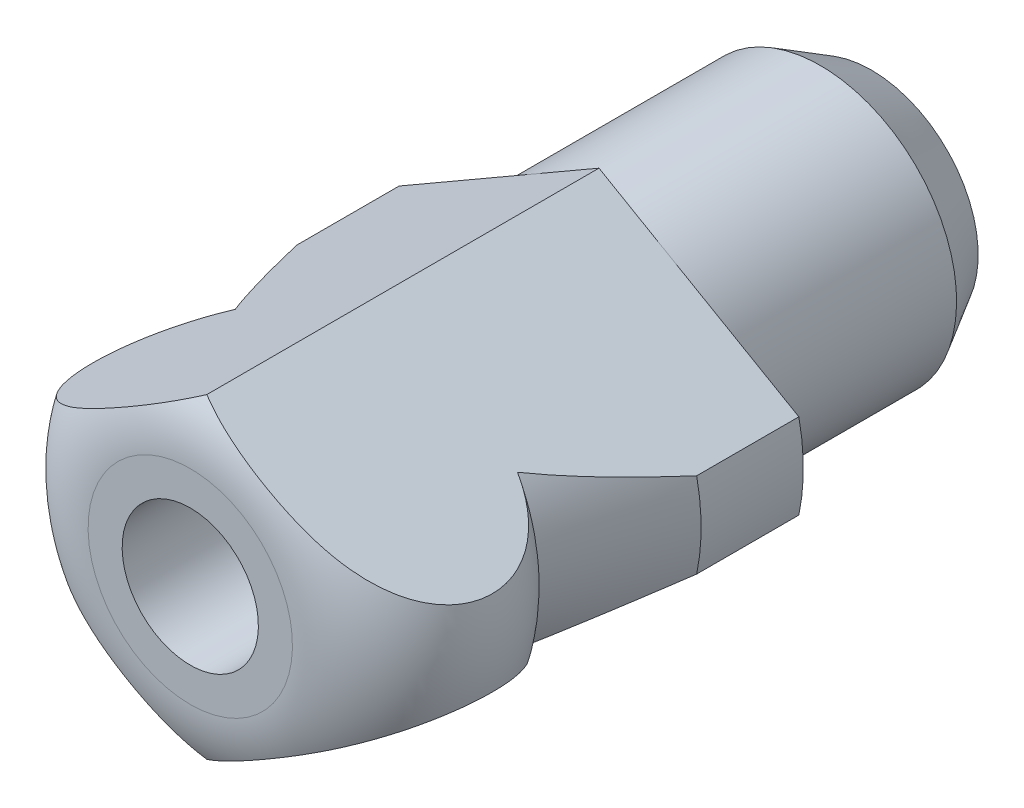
ISO-10303-21;
HEADER;
FILE_DESCRIPTION(('STEP AP214'),'2;1');
FILE_NAME('part.step','',(''),(''),'','','');
FILE_SCHEMA(('AUTOMOTIVE_DESIGN { 1 0 10303 214 1 1 1 1 }'));
ENDSEC;
DATA;
#1=APPLICATION_CONTEXT('core data for automotive mechanical design processes');
#2=APPLICATION_PROTOCOL_DEFINITION('international standard','automotive_design',2000,#1);
#3=PRODUCT_CONTEXT('',#1,'mechanical');
#4=PRODUCT('Part','Part','',(#3));
#5=PRODUCT_RELATED_PRODUCT_CATEGORY('part','',(#4));
#6=PRODUCT_DEFINITION_FORMATION('','',#4);
#7=PRODUCT_DEFINITION_CONTEXT('part definition',#1,'design');
#8=PRODUCT_DEFINITION('design','',#6,#7);
#9=PRODUCT_DEFINITION_SHAPE('','',#8);
#10=(LENGTH_UNIT() NAMED_UNIT(*) SI_UNIT(.MILLI.,.METRE.));
#11=(NAMED_UNIT(*) PLANE_ANGLE_UNIT() SI_UNIT($,.RADIAN.));
#12=(NAMED_UNIT(*) SI_UNIT($,.STERADIAN.) SOLID_ANGLE_UNIT());
#13=UNCERTAINTY_MEASURE_WITH_UNIT(LENGTH_MEASURE(1.E-05),#10,'distance_accuracy_value','');
#14=(GEOMETRIC_REPRESENTATION_CONTEXT(3) GLOBAL_UNCERTAINTY_ASSIGNED_CONTEXT((#13)) GLOBAL_UNIT_ASSIGNED_CONTEXT((#10,
#11,#12)) REPRESENTATION_CONTEXT('',''));
#15=CARTESIAN_POINT('',(0.,0.,0.));
#16=DIRECTION('',(0.,0.,1.));
#17=DIRECTION('',(1.,0.,0.));
#18=AXIS2_PLACEMENT_3D('',#15,#16,#17);
#19=CARTESIAN_POINT('',(-4.,0.,0.));
#20=DIRECTION('',(0.,0.,1.));
#21=DIRECTION('',(0.,1.,0.));
#22=AXIS2_PLACEMENT_3D('',#19,#20,#21);
#23=PLANE('',#22);
#24=CARTESIAN_POINT('',(0.,0.,0.));
#25=DIRECTION('',(0.,0.,-1.));
#26=DIRECTION('',(0.,-1.,0.));
#27=AXIS2_PLACEMENT_3D('',#24,#25,#26);
#28=CIRCLE('',#27,4.);
#29=CARTESIAN_POINT('',(0.,-4.,0.));
#30=VERTEX_POINT('',#29);
#31=EDGE_CURVE('E173',#30,#30,#28,.T.);
#32=ORIENTED_EDGE('',*,*,#31,.F.);
#33=EDGE_LOOP('',(#32));
#34=FACE_BOUND('',#33,.T.);
#35=DIRECTION('',(0.866025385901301,0.500000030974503,0.));
#36=VECTOR('',#35,1.);
#37=CARTESIAN_POINT('',(-0.991647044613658,-5.21061973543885,0.));
#38=LINE('',#37,#36);
#39=CARTESIAN_POINT('',(0.,-4.638092,0.));
#40=VERTEX_POINT('',#39);
#41=CARTESIAN_POINT('',(5.868347,-1.25,0.));
#42=VERTEX_POINT('',#41);
#43=EDGE_CURVE('E189',#40,#42,#38,.T.);
#44=ORIENTED_EDGE('',*,*,#43,.F.);
#45=DIRECTION('',(0.866025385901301,-0.500000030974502,0.));
#46=VECTOR('',#45,1.);
#47=CARTESIAN_POINT('',(-5.00835270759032,-1.746517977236,0.));
#48=LINE('',#47,#46);
#49=CARTESIAN_POINT('',(-5.868347,-1.25,0.));
#50=VERTEX_POINT('',#49);
#51=EDGE_CURVE('E113',#50,#40,#48,.T.);
#52=ORIENTED_EDGE('',*,*,#51,.F.);
#53=CARTESIAN_POINT('',(0.,0.,0.));
#54=DIRECTION('',(0.,0.,-1.));
#55=DIRECTION('',(0.,-1.,0.));
#56=AXIS2_PLACEMENT_3D('',#53,#54,#55);
#57=CIRCLE('',#56,6.);
#58=CARTESIAN_POINT('',(-5.868347,1.25,0.));
#59=VERTEX_POINT('',#58);
#60=EDGE_CURVE('E110',#50,#59,#57,.T.);
#61=ORIENTED_EDGE('',*,*,#60,.T.);
#62=DIRECTION('',(-0.866025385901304,-0.500000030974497,0.));
#63=VECTOR('',#62,1.);
#64=CARTESIAN_POINT('',(-5.00835270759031,1.746517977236,0.));
#65=LINE('',#64,#63);
#66=CARTESIAN_POINT('',(0.,4.638092,0.));
#67=VERTEX_POINT('',#66);
#68=EDGE_CURVE('E100',#67,#59,#65,.T.);
#69=ORIENTED_EDGE('',*,*,#68,.F.);
#70=DIRECTION('',(-0.866025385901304,0.500000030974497,0.));
#71=VECTOR('',#70,1.);
#72=CARTESIAN_POINT('',(-0.991647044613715,5.21061973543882,0.));
#73=LINE('',#72,#71);
#74=CARTESIAN_POINT('',(5.868347,1.25,0.));
#75=VERTEX_POINT('',#74);
#76=EDGE_CURVE('E84',#75,#67,#73,.T.);
#77=ORIENTED_EDGE('',*,*,#76,.F.);
#78=EDGE_CURVE('E177',#75,#42,#57,.T.);
#79=ORIENTED_EDGE('',*,*,#78,.T.);
#80=EDGE_LOOP('',(#44,#52,#61,#69,#77,#79));
#81=FACE_BOUND('',#80,.T.);
#82=ADVANCED_FACE('F14',(#34,#81),#23,.F.);
#83=CARTESIAN_POINT('',(0.,0.,-8.));
#84=DIRECTION('',(0.,0.,-1.));
#85=DIRECTION('',(0.,-1.,0.));
#86=AXIS2_PLACEMENT_3D('',#83,#84,#85);
#87=CYLINDRICAL_SURFACE('',#86,6.);
#88=DIRECTION('',(0.,0.,1.));
#89=VECTOR('',#88,1.);
#90=CARTESIAN_POINT('',(5.868347,-1.25,-8.));
#91=LINE('',#90,#89);
#92=CARTESIAN_POINT('',(5.868347,-1.25,3.00000079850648));
#93=VERTEX_POINT('',#92);
#94=EDGE_CURVE('E40',#42,#93,#91,.T.);
#95=ORIENTED_EDGE('',*,*,#94,.F.);
#96=ORIENTED_EDGE('',*,*,#78,.F.);
#97=DIRECTION('',(0.,0.,1.));
#98=VECTOR('',#97,1.);
#99=CARTESIAN_POINT('',(5.868347,1.25,-8.));
#100=LINE('',#99,#98);
#101=CARTESIAN_POINT('',(5.868347,1.25,3.00000079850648));
#102=VERTEX_POINT('',#101);
#103=EDGE_CURVE('E89',#75,#102,#100,.T.);
#104=ORIENTED_EDGE('',*,*,#103,.T.);
#105=CARTESIAN_POINT('',(0.,0.,3.));
#106=DIRECTION('',(0.,0.,-1.));
#107=DIRECTION('',(0.,-1.,0.));
#108=AXIS2_PLACEMENT_3D('',#105,#106,#107);
#109=CIRCLE('',#108,6.);
#110=EDGE_CURVE('E181',#102,#93,#109,.T.);
#111=ORIENTED_EDGE('',*,*,#110,.T.);
#112=EDGE_LOOP('',(#95,#96,#104,#111));
#113=FACE_BOUND('',#112,.T.);
#114=ADVANCED_FACE('F203',(#113),#87,.T.);
#115=DIRECTION('',(0.,0.,1.));
#116=VECTOR('',#115,1.);
#117=CARTESIAN_POINT('',(-5.868347,-1.25,-8.));
#118=LINE('',#117,#116);
#119=CARTESIAN_POINT('',(-5.868347,-1.25,3.00000079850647));
#120=VERTEX_POINT('',#119);
#121=EDGE_CURVE('E200',#50,#120,#118,.T.);
#122=ORIENTED_EDGE('',*,*,#121,.T.);
#123=CARTESIAN_POINT('',(-5.868347,1.25,3.00000079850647));
#124=VERTEX_POINT('',#123);
#125=EDGE_CURVE('E178',#120,#124,#109,.T.);
#126=ORIENTED_EDGE('',*,*,#125,.T.);
#127=DIRECTION('',(0.,0.,1.));
#128=VECTOR('',#127,1.);
#129=CARTESIAN_POINT('',(-5.868347,1.25,-8.));
#130=LINE('',#129,#128);
#131=EDGE_CURVE('E104',#59,#124,#130,.T.);
#132=ORIENTED_EDGE('',*,*,#131,.F.);
#133=ORIENTED_EDGE('',*,*,#60,.F.);
#134=EDGE_LOOP('',(#122,#126,#132,#133));
#135=FACE_BOUND('',#134,.T.);
#136=ADVANCED_FACE('F243',(#135),#87,.T.);
#137=CARTESIAN_POINT('',(0.,0.,6.53691825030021));
#138=DIRECTION('',(0.,0.,-1.));
#139=DIRECTION('',(0.,-1.,0.));
#140=AXIS2_PLACEMENT_3D('',#137,#138,#139);
#141=CONICAL_SURFACE('',#140,4.71266701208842,0.349065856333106);
#142=CARTESIAN_POINT('',(7.66639696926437,-0.211895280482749,-1.58643196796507));
#143=CARTESIAN_POINT('',(7.58991622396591,-0.256051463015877,-1.3797408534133));
#144=CARTESIAN_POINT('',(7.51307988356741,-0.300412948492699,-1.1732252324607));
#145=CARTESIAN_POINT('',(7.3585959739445,-0.389604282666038,-0.760596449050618));
#146=CARTESIAN_POINT('',(7.28094839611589,-0.434434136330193,-0.554483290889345));
#147=CARTESIAN_POINT('',(7.04656184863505,-0.569757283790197,0.0633778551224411));
#148=CARTESIAN_POINT('',(6.88845655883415,-0.661039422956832,0.474437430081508));
#149=CARTESIAN_POINT('',(6.56461752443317,-0.848007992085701,1.30146675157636));
#150=CARTESIAN_POINT('',(6.39879769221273,-0.943744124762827,1.71739168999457));
#151=CARTESIAN_POINT('',(6.06057752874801,-1.13901564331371,2.54549626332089));
#152=CARTESIAN_POINT('',(5.88817958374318,-1.23854965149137,2.95767719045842));
#153=CARTESIAN_POINT('',(5.56955797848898,-1.42250593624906,3.69440710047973));
#154=CARTESIAN_POINT('',(5.4250325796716,-1.50594772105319,4.01992800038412));
#155=CARTESIAN_POINT('',(5.20193111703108,-1.63475542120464,4.5045285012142));
#156=CARTESIAN_POINT('',(5.12647530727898,-1.67831985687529,4.66552226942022));
#157=CARTESIAN_POINT('',(4.97305390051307,-1.76689775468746,4.9859042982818));
#158=CARTESIAN_POINT('',(4.89508840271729,-1.81191115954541,5.14529262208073));
#159=CARTESIAN_POINT('',(4.73662927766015,-1.90339758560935,5.4610059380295));
#160=CARTESIAN_POINT('',(4.65615542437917,-1.94985919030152,5.61734412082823));
#161=CARTESIAN_POINT('',(4.49150579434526,-2.04491970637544,5.92738997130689));
#162=CARTESIAN_POINT('',(4.40733043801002,-2.09351837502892,6.0810979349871));
#163=CARTESIAN_POINT('',(4.23442999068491,-2.19334250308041,6.38477145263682));
#164=CARTESIAN_POINT('',(4.14571143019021,-2.24456419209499,6.5347419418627));
#165=CARTESIAN_POINT('',(3.96230925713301,-2.35045149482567,6.82971070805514));
#166=CARTESIAN_POINT('',(3.86762844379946,-2.40511549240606,6.97471126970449));
#167=CARTESIAN_POINT('',(3.72123294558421,-2.48963697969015,7.18442626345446));
#168=CARTESIAN_POINT('',(3.67255348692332,-2.51774208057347,7.25196561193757));
#169=CARTESIAN_POINT('',(3.57302025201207,-2.57520762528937,7.38490271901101));
#170=CARTESIAN_POINT('',(3.52216612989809,-2.60456826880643,7.45030013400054));
#171=CARTESIAN_POINT('',(3.41790827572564,-2.66476157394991,7.57843488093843));
#172=CARTESIAN_POINT('',(3.36450274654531,-2.69559527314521,7.64117027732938));
#173=CARTESIAN_POINT('',(3.25478009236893,-2.75894368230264,7.7631289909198));
#174=CARTESIAN_POINT('',(3.19846363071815,-2.79145800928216,7.82235310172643));
#175=CARTESIAN_POINT('',(3.05248153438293,-2.87574081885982,7.96570883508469));
#176=CARTESIAN_POINT('',(2.96060808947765,-2.92878398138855,8.04691552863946));
#177=CARTESIAN_POINT('',(2.76758592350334,-3.0402253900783,8.19314016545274));
#178=CARTESIAN_POINT('',(2.66646223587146,-3.09860918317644,8.25820012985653));
#179=CARTESIAN_POINT('',(2.48971400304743,-3.20065483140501,8.34610523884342));
#180=CARTESIAN_POINT('',(2.41668780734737,-3.24281652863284,8.37579623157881));
#181=CARTESIAN_POINT('',(2.26743784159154,-3.328986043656,8.4209860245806));
#182=CARTESIAN_POINT('',(2.19122005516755,-3.37299040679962,8.43651023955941));
#183=CARTESIAN_POINT('',(2.0371280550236,-3.46195547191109,8.45139322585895));
#184=CARTESIAN_POINT('',(1.95924690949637,-3.50692017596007,8.45066004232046));
#185=CARTESIAN_POINT('',(1.80486302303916,-3.596053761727,8.43291102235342));
#186=CARTESIAN_POINT('',(1.72836195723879,-3.64022167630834,8.41587659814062));
#187=CARTESIAN_POINT('',(1.56114460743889,-3.73676466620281,8.36206329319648));
#188=CARTESIAN_POINT('',(1.47134663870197,-3.78860955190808,8.3215669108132));
#189=CARTESIAN_POINT('',(1.29840419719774,-3.88845792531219,8.22482658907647));
#190=CARTESIAN_POINT('',(1.21527498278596,-3.93645260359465,8.16854779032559));
#191=CARTESIAN_POINT('',(1.0610134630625,-4.02551554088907,8.04941597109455));
#192=CARTESIAN_POINT('',(0.989448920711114,-4.06683335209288,7.98729127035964));
#193=CARTESIAN_POINT('',(0.851091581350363,-4.1467140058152,7.85625743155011));
#194=CARTESIAN_POINT('',(0.784303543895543,-4.1852741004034,7.78734168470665));
#195=CARTESIAN_POINT('',(0.654596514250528,-4.26016049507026,7.64437773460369));
#196=CARTESIAN_POINT('',(0.591691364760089,-4.29647880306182,7.5703129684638));
#197=CARTESIAN_POINT('',(0.469354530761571,-4.36711001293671,7.41855071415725));
#198=CARTESIAN_POINT('',(0.40992109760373,-4.40142392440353,7.34085509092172));
#199=CARTESIAN_POINT('',(0.293916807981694,-4.46839903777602,7.18263130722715));
#200=CARTESIAN_POINT('',(0.237347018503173,-4.50105962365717,7.10210210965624));
#201=CARTESIAN_POINT('',(0.126643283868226,-4.56497445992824,6.93883542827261));
#202=CARTESIAN_POINT('',(0.0725096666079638,-4.5962285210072,6.85609764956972));
#203=CARTESIAN_POINT('',(-0.0868550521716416,-4.68823779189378,6.60516761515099));
#204=CARTESIAN_POINT('',(-0.18898469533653,-4.74720237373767,6.43435010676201));
#205=CARTESIAN_POINT('',(-0.387310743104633,-4.86170598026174,6.08768160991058));
#206=CARTESIAN_POINT('',(-0.483492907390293,-4.91723678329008,5.91181991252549));
#207=CARTESIAN_POINT('',(-0.671109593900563,-5.02555733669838,5.55673575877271));
#208=CARTESIAN_POINT('',(-0.762543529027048,-5.07834674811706,5.37751289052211));
#209=CARTESIAN_POINT('',(-0.942163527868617,-5.18205041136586,5.01557466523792));
#210=CARTESIAN_POINT('',(-1.03032829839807,-5.23295236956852,4.83284528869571));
#211=CARTESIAN_POINT('',(-1.2035993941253,-5.33299049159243,4.46545279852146));
#212=CARTESIAN_POINT('',(-1.28870549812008,-5.38212652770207,4.28078954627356));
#213=CARTESIAN_POINT('',(-1.54003913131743,-5.52723408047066,3.72509601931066));
#214=CARTESIAN_POINT('',(-1.70254445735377,-5.62105658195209,3.3518230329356));
#215=CARTESIAN_POINT('',(-2.02175057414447,-5.8053503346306,2.59862803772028));
#216=CARTESIAN_POINT('',(-2.17840012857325,-5.89579200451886,2.21867735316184));
#217=CARTESIAN_POINT('',(-2.48655215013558,-6.07370367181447,1.4557921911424));
#218=CARTESIAN_POINT('',(-2.63805215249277,-6.16117224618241,1.07285638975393));
#219=CARTESIAN_POINT('',(-2.93461113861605,-6.3323906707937,0.31125238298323));
#220=CARTESIAN_POINT('',(-3.0797351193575,-6.41617804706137,-0.067382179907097));
#221=CARTESIAN_POINT('',(-3.29510801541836,-6.54052365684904,-0.636368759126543));
#222=CARTESIAN_POINT('',(-3.36649337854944,-6.58173801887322,-0.826148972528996));
#223=CARTESIAN_POINT('',(-3.50858352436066,-6.66377380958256,-1.20604715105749));
#224=CARTESIAN_POINT('',(-3.57928831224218,-6.70459524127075,-1.39616511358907));
#225=CARTESIAN_POINT('',(-3.64969130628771,-6.74524243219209,-1.58643196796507));
#226=B_SPLINE_CURVE_WITH_KNOTS('',3,(#142,#143,#144,#145,#146,#147,#148,#149,#150,#151,#152,
#153,#154,#155,#156,#157,#158,#159,#160,#161,#162,#163,#164,#165,#166,#167,#168,#169,#170,#171,
#172,#173,#174,#175,#176,#177,#178,#179,#180,#181,#182,#183,#184,#185,#186,#187,#188,#189,#190,
#191,#192,#193,#194,#195,#196,#197,#198,#199,#200,#201,#202,#203,#204,#205,#206,#207,#208,#209,
#210,#211,#212,#213,#214,#215,#216,#217,#218,#219,#220,#221,#222,#223,#224,#225),.UNSPECIFIED.,
.F.,.F.,(4,2,2,2,2,2,2,2,2,2,2,2,2,2,2,2,2,2,2,2,2,2,2,2,2,2,2,2,2,2,2,2,2,2,2,2,2,2,2,2,2,4),
(0.,0.67430071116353,1.34860858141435,2.69790933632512,4.07149858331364,5.44459420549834,
6.54188097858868,7.09103350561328,7.64016434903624,8.18571854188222,8.73121092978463,
9.27594009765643,9.82041539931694,10.0839771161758,10.3475809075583,10.6113731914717,
10.8751056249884,11.2749853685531,11.6738132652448,11.9410212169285,12.2077488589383,
12.4759855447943,12.7445284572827,13.0765981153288,13.4094070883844,13.7190957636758,
14.029088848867,14.3401298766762,14.6510128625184,14.962010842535,15.2730505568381,
15.895485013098,16.5193562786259,17.1433045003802,17.770781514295,18.3983038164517,
19.6514944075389,20.9138644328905,22.1768304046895,23.4189871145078,24.0397104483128,
24.6604290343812),.UNSPECIFIED.);
#227=CARTESIAN_POINT('',(4.14294431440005,-2.24616178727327,6.53691825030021));
#228=VERTEX_POINT('',#227);
#229=EDGE_CURVE('E190',#93,#228,#226,.T.);
#230=ORIENTED_EDGE('',*,*,#229,.F.);
#231=ORIENTED_EDGE('',*,*,#110,.F.);
#232=CARTESIAN_POINT('',(-3.64969130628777,6.74524243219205,-1.58643196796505));
#233=CARTESIAN_POINT('',(-3.57321056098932,6.70108624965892,-1.37974085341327));
#234=CARTESIAN_POINT('',(-3.49637422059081,6.65672476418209,-1.17322523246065));
#235=CARTESIAN_POINT('',(-3.34189031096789,6.56753343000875,-0.760596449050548));
#236=CARTESIAN_POINT('',(-3.26424273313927,6.52270357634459,-0.554483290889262));
#237=CARTESIAN_POINT('',(-3.02985618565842,6.38738042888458,0.0633778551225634));
#238=CARTESIAN_POINT('',(-2.87175089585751,6.29609828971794,0.474437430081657));
#239=CARTESIAN_POINT('',(-2.54791186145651,6.10912972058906,1.30146675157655));
#240=CARTESIAN_POINT('',(-2.38209202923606,6.01339358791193,1.71739168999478));
#241=CARTESIAN_POINT('',(-2.04387186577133,5.81812206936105,2.54549626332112));
#242=CARTESIAN_POINT('',(-1.87147392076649,5.7185880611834,2.95767719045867));
#243=CARTESIAN_POINT('',(-1.55285231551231,5.53463177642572,3.6944071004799));
#244=CARTESIAN_POINT('',(-1.40832691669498,5.45118999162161,4.0199280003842));
#245=CARTESIAN_POINT('',(-1.18522545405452,5.3223822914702,4.50452850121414));
#246=CARTESIAN_POINT('',(-1.10976964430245,5.27881785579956,4.66552226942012));
#247=CARTESIAN_POINT('',(-0.956348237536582,5.19023995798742,4.98590429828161));
#248=CARTESIAN_POINT('',(-0.878382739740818,5.14522655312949,5.1452926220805));
#249=CARTESIAN_POINT('',(-0.719923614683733,5.05374012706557,5.46100593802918));
#250=CARTESIAN_POINT('',(-0.639449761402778,5.00727852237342,5.61734412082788));
#251=CARTESIAN_POINT('',(-0.474800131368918,4.91221800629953,5.92738997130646));
#252=CARTESIAN_POINT('',(-0.3906247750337,4.86361933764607,6.08109793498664));
#253=CARTESIAN_POINT('',(-0.217724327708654,4.76379520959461,6.38477145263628));
#254=CARTESIAN_POINT('',(-0.129005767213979,4.71257352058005,6.53474194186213));
#255=CARTESIAN_POINT('',(0.0543964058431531,4.60668621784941,6.8297107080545));
#256=CARTESIAN_POINT('',(0.149077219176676,4.55202222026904,6.97471126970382));
#257=CARTESIAN_POINT('',(0.295472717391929,4.46750073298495,7.18442626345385));
#258=CARTESIAN_POINT('',(0.344152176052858,4.43939563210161,7.25196561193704));
#259=CARTESIAN_POINT('',(0.443685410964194,4.38193008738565,7.38490271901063));
#260=CARTESIAN_POINT('',(0.494539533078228,4.35256944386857,7.45030013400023));
#261=CARTESIAN_POINT('',(0.59879738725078,4.29237613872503,7.57843488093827));
#262=CARTESIAN_POINT('',(0.65220291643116,4.2615424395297,7.64117027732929));
#263=CARTESIAN_POINT('',(0.761925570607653,4.1981940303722,7.76312899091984));
#264=CARTESIAN_POINT('',(0.818242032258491,4.16567970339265,7.82235310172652));
#265=CARTESIAN_POINT('',(0.964224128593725,4.08139689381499,7.96570883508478));
#266=CARTESIAN_POINT('',(1.05609757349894,4.02835373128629,8.04691552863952));
#267=CARTESIAN_POINT('',(1.24911973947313,3.91691232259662,8.19314016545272));
#268=CARTESIAN_POINT('',(1.35024342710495,3.85852852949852,8.25820012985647));
#269=CARTESIAN_POINT('',(1.52699165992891,3.75648288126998,8.34610523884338));
#270=CARTESIAN_POINT('',(1.60001785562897,3.71432118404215,8.37579623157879));
#271=CARTESIAN_POINT('',(1.74926782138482,3.62815166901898,8.42098602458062));
#272=CARTESIAN_POINT('',(1.82548560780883,3.58414730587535,8.43651023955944));
#273=CARTESIAN_POINT('',(1.97957760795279,3.49518224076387,8.45139322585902));
#274=CARTESIAN_POINT('',(2.05745875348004,3.45021753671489,8.45066004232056));
#275=CARTESIAN_POINT('',(2.21184263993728,3.36108395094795,8.43291102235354));
#276=CARTESIAN_POINT('',(2.28834370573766,3.3169160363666,8.41587659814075));
#277=CARTESIAN_POINT('',(2.45556105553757,3.22037304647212,8.36206329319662));
#278=CARTESIAN_POINT('',(2.54535902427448,3.16852816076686,8.32156691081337));
#279=CARTESIAN_POINT('',(2.71830146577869,3.06867978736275,8.22482658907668));
#280=CARTESIAN_POINT('',(2.80143068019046,3.0206851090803,8.16854779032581));
#281=CARTESIAN_POINT('',(2.9556921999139,2.9316221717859,8.04941597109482));
#282=CARTESIAN_POINT('',(3.02725674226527,2.8903043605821,7.98729127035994));
#283=CARTESIAN_POINT('',(3.165614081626,2.81042370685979,7.85625743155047));
#284=CARTESIAN_POINT('',(3.2324021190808,2.7718636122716,7.78734168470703));
#285=CARTESIAN_POINT('',(3.36210914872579,2.69697721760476,7.64437773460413));
#286=CARTESIAN_POINT('',(3.42501429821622,2.66065890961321,7.57031296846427));
#287=CARTESIAN_POINT('',(3.54735113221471,2.59002769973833,7.41855071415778));
#288=CARTESIAN_POINT('',(3.60678456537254,2.55571378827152,7.34085509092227));
#289=CARTESIAN_POINT('',(3.72278885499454,2.48873867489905,7.18263130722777));
#290=CARTESIAN_POINT('',(3.77935864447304,2.45607808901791,7.10210210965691));
#291=CARTESIAN_POINT('',(3.89006237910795,2.39216325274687,6.93883542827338));
#292=CARTESIAN_POINT('',(3.94419599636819,2.36090919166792,6.85609764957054));
#293=CARTESIAN_POINT('',(4.10356071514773,2.26889992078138,6.60516761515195));
#294=CARTESIAN_POINT('',(4.20569035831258,2.20993533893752,6.43435010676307));
#295=CARTESIAN_POINT('',(4.40401640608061,2.09543173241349,6.08768160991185));
#296=CARTESIAN_POINT('',(4.50019857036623,2.03990092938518,5.91181991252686));
#297=CARTESIAN_POINT('',(4.68781525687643,1.93158037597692,5.55673575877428));
#298=CARTESIAN_POINT('',(4.77924919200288,1.87879096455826,5.37751289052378));
#299=CARTESIAN_POINT('',(4.95886919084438,1.77508730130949,5.01557466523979));
#300=CARTESIAN_POINT('',(5.0470339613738,1.72418534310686,4.83284528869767));
#301=CARTESIAN_POINT('',(5.22030505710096,1.62414722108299,4.46545279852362));
#302=CARTESIAN_POINT('',(5.30541116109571,1.57501118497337,4.28078954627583));
#303=CARTESIAN_POINT('',(5.55674479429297,1.42990363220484,3.72509601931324));
#304=CARTESIAN_POINT('',(5.71925012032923,1.33608113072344,3.35182303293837));
#305=CARTESIAN_POINT('',(6.03845623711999,1.1517873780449,2.59862803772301));
#306=CARTESIAN_POINT('',(6.1951057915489,1.06134570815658,2.21867735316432));
#307=CARTESIAN_POINT('',(6.50325781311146,0.883434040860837,1.45579219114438));
#308=CARTESIAN_POINT('',(6.65475781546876,0.795965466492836,1.07285638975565));
#309=CARTESIAN_POINT('',(6.95131680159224,0.624747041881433,0.31125238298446));
#310=CARTESIAN_POINT('',(7.09644078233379,0.540959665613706,-0.067382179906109));
#311=CARTESIAN_POINT('',(7.31181367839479,0.416614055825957,-0.63636875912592));
#312=CARTESIAN_POINT('',(7.38319904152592,0.375399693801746,-0.826148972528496));
#313=CARTESIAN_POINT('',(7.52528918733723,0.293363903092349,-1.20604715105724));
#314=CARTESIAN_POINT('',(7.59599397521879,0.252542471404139,-1.39616511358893));
#315=CARTESIAN_POINT('',(7.66639696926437,0.211895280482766,-1.58643196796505));
#316=B_SPLINE_CURVE_WITH_KNOTS('',3,(#232,#233,#234,#235,#236,#237,#238,#239,#240,#241,#242,
#243,#244,#245,#246,#247,#248,#249,#250,#251,#252,#253,#254,#255,#256,#257,#258,#259,#260,#261,
#262,#263,#264,#265,#266,#267,#268,#269,#270,#271,#272,#273,#274,#275,#276,#277,#278,#279,#280,
#281,#282,#283,#284,#285,#286,#287,#288,#289,#290,#291,#292,#293,#294,#295,#296,#297,#298,#299,
#300,#301,#302,#303,#304,#305,#306,#307,#308,#309,#310,#311,#312,#313,#314,#315),.UNSPECIFIED.,
.F.,.F.,(4,2,2,2,2,2,2,2,2,2,2,2,2,2,2,2,2,2,2,2,2,2,2,2,2,2,2,2,2,2,2,2,2,2,2,2,2,2,2,2,2,4),
(0.,0.674300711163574,1.34860858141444,2.6979093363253,4.07149858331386,5.44459420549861,
6.54188097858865,7.0910335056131,7.64016434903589,8.18571854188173,8.731210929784,
9.27594009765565,9.82041539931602,10.0839771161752,10.3475809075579,10.6113731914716,
10.8751056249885,11.2749853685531,11.6738132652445,11.9410212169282,12.2077488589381,
12.4759855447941,12.7445284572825,13.0765981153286,13.4094070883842,13.7190957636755,
14.0290888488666,14.3401298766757,14.6510128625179,14.9620108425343,15.2730505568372,
15.8954850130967,16.5193562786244,17.1433045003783,17.7707815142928,18.3983038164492,
19.6514944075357,20.9138644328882,22.1768304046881,23.4189871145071,24.0397104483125,
24.6604290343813),.UNSPECIFIED.);
#317=CARTESIAN_POINT('',(4.14294431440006,2.24616178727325,6.53691825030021));
#318=VERTEX_POINT('',#317);
#319=EDGE_CURVE('E95',#318,#102,#316,.T.);
#320=ORIENTED_EDGE('',*,*,#319,.F.);
#321=CARTESIAN_POINT('',(0.,0.,6.53691825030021));
#322=DIRECTION('',(0.,0.,-1.));
#323=DIRECTION('',(0.,-1.,0.));
#324=AXIS2_PLACEMENT_3D('',#321,#322,#323);
#325=CIRCLE('',#324,4.71266701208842);
#326=EDGE_CURVE('E185',#318,#228,#325,.T.);
#327=ORIENTED_EDGE('',*,*,#326,.T.);
#328=EDGE_LOOP('',(#230,#231,#320,#327));
#329=FACE_BOUND('',#328,.T.);
#330=ADVANCED_FACE('F129',(#329),#141,.T.);
#331=CARTESIAN_POINT('',(3.64969130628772,-6.74524243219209,-1.58643196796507));
#332=CARTESIAN_POINT('',(3.57321056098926,-6.70108624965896,-1.3797408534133));
#333=CARTESIAN_POINT('',(3.49637422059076,-6.65672476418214,-1.1732252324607));
#334=CARTESIAN_POINT('',(3.34189031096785,-6.5675334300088,-0.760596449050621));
#335=CARTESIAN_POINT('',(3.26424273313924,-6.52270357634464,-0.554483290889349));
#336=CARTESIAN_POINT('',(3.0298561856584,-6.38738042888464,0.0633778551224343));
#337=CARTESIAN_POINT('',(2.8717508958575,-6.29609828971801,0.474437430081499));
#338=CARTESIAN_POINT('',(2.54791186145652,-6.10912972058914,1.30146675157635));
#339=CARTESIAN_POINT('',(2.38209202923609,-6.01339358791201,1.71739168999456));
#340=CARTESIAN_POINT('',(2.04387186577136,-5.81812206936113,2.54549626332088));
#341=CARTESIAN_POINT('',(1.87147392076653,-5.71858806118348,2.9576771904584));
#342=CARTESIAN_POINT('',(1.55285231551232,-5.53463177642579,3.69440710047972));
#343=CARTESIAN_POINT('',(1.40832691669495,-5.45118999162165,4.01992800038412));
#344=CARTESIAN_POINT('',(1.18522545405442,-5.3223822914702,4.50452850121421));
#345=CARTESIAN_POINT('',(1.10976964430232,-5.27881785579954,4.66552226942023));
#346=CARTESIAN_POINT('',(0.956348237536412,-5.19023995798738,4.98590429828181));
#347=CARTESIAN_POINT('',(0.878382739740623,-5.14522655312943,5.14529262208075));
#348=CARTESIAN_POINT('',(0.719923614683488,-5.05374012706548,5.46100593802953));
#349=CARTESIAN_POINT('',(0.639449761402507,-5.00727852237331,5.61734412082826));
#350=CARTESIAN_POINT('',(0.474800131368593,-4.91221800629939,5.92738997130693));
#351=CARTESIAN_POINT('',(0.390624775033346,-4.86361933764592,6.08109793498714));
#352=CARTESIAN_POINT('',(0.217724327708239,-4.76379520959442,6.38477145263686));
#353=CARTESIAN_POINT('',(0.129005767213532,-4.71257352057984,6.53474194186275));
#354=CARTESIAN_POINT('',(-0.054396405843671,-4.60668621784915,6.82971070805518));
#355=CARTESIAN_POINT('',(-0.149077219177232,-4.55202222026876,6.97471126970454));
#356=CARTESIAN_POINT('',(-0.295472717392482,-4.46750073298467,7.18442626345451));
#357=CARTESIAN_POINT('',(-0.344152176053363,-4.43939563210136,7.25196561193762));
#358=CARTESIAN_POINT('',(-0.4436854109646,-4.38193008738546,7.38490271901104));
#359=CARTESIAN_POINT('',(-0.494539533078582,-4.3525694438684,7.45030013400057));
#360=CARTESIAN_POINT('',(-0.598797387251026,-4.29237613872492,7.57843488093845));
#361=CARTESIAN_POINT('',(-0.652202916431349,-4.26154243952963,7.64117027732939));
#362=CARTESIAN_POINT('',(-0.761925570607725,-4.1981940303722,7.76312899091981));
#363=CARTESIAN_POINT('',(-0.818242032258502,-4.16567970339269,7.82235310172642));
#364=CARTESIAN_POINT('',(-0.964224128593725,-4.08139689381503,7.96570883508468));
#365=CARTESIAN_POINT('',(-1.056097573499,-4.02835373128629,8.04691552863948));
#366=CARTESIAN_POINT('',(-1.24911973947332,-3.91691232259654,8.19314016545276));
#367=CARTESIAN_POINT('',(-1.35024342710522,-3.8585285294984,8.25820012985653));
#368=CARTESIAN_POINT('',(-1.52699165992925,-3.75648288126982,8.34610523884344));
#369=CARTESIAN_POINT('',(-1.60001785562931,-3.71432118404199,8.37579623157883));
#370=CARTESIAN_POINT('',(-1.74926782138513,-3.62815166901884,8.42098602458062));
#371=CARTESIAN_POINT('',(-1.82548560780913,-3.58414730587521,8.43651023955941));
#372=CARTESIAN_POINT('',(-1.97957760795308,-3.49518224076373,8.45139322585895));
#373=CARTESIAN_POINT('',(-2.05745875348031,-3.45021753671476,8.45066004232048));
#374=CARTESIAN_POINT('',(-2.21184263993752,-3.36108395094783,8.43291102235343));
#375=CARTESIAN_POINT('',(-2.28834370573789,-3.31691603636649,8.41587659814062));
#376=CARTESIAN_POINT('',(-2.45556105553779,-3.22037304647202,8.36206329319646));
#377=CARTESIAN_POINT('',(-2.54535902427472,-3.16852816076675,8.3215669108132));
#378=CARTESIAN_POINT('',(-2.71830146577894,-3.06867978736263,8.22482658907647));
#379=CARTESIAN_POINT('',(-2.80143068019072,-3.02068510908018,8.16854779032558));
#380=CARTESIAN_POINT('',(-2.95569219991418,-2.93162217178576,8.04941597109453));
#381=CARTESIAN_POINT('',(-3.02725674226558,-2.89030436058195,7.98729127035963));
#382=CARTESIAN_POINT('',(-3.16561408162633,-2.81042370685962,7.8562574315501));
#383=CARTESIAN_POINT('',(-3.23240211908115,-2.77186361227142,7.78734168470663));
#384=CARTESIAN_POINT('',(-3.36210914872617,-2.69697721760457,7.64437773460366));
#385=CARTESIAN_POINT('',(-3.42501429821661,-2.660658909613,7.57031296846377));
#386=CARTESIAN_POINT('',(-3.54735113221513,-2.59002769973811,7.41855071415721));
#387=CARTESIAN_POINT('',(-3.60678456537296,-2.55571378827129,7.34085509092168));
#388=CARTESIAN_POINT('',(-3.722788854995,-2.4887386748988,7.18263130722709));
#389=CARTESIAN_POINT('',(-3.77935864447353,-2.45607808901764,7.10210210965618));
#390=CARTESIAN_POINT('',(-3.89006237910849,-2.39216325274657,6.93883542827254));
#391=CARTESIAN_POINT('',(-3.94419599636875,-2.36090919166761,6.85609764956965));
#392=CARTESIAN_POINT('',(-4.10356071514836,-2.26889992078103,6.6051676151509));
#393=CARTESIAN_POINT('',(-4.20569035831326,-2.20993533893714,6.43435010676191));
#394=CARTESIAN_POINT('',(-4.40401640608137,-2.09543173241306,6.08768160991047));
#395=CARTESIAN_POINT('',(-4.50019857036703,-2.03990092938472,5.91181991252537));
#396=CARTESIAN_POINT('',(-4.68781525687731,-1.93158037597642,5.55673575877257));
#397=CARTESIAN_POINT('',(-4.77924919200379,-1.87879096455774,5.37751289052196));
#398=CARTESIAN_POINT('',(-4.95886919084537,-1.77508730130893,5.01557466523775));
#399=CARTESIAN_POINT('',(-5.04703396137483,-1.72418534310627,4.83284528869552));
#400=CARTESIAN_POINT('',(-5.22030505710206,-1.62414722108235,4.46545279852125));
#401=CARTESIAN_POINT('',(-5.30541116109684,-1.57501118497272,4.28078954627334));
#402=CARTESIAN_POINT('',(-5.55674479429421,-1.42990363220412,3.72509601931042));
#403=CARTESIAN_POINT('',(-5.71925012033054,-1.33608113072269,3.35182303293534));
#404=CARTESIAN_POINT('',(-6.03845623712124,-1.15178737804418,2.59862803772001));
#405=CARTESIAN_POINT('',(-6.19510579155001,-1.06134570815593,2.2186773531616));
#406=CARTESIAN_POINT('',(-6.50325781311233,-0.883434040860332,1.45579219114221));
#407=CARTESIAN_POINT('',(-6.65475781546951,-0.795965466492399,1.07285638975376));
#408=CARTESIAN_POINT('',(-6.95131680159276,-0.624747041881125,0.311252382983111));
#409=CARTESIAN_POINT('',(-7.0964407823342,-0.540959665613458,-0.0673821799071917));
#410=CARTESIAN_POINT('',(-7.31181367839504,-0.416614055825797,-0.636368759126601));
#411=CARTESIAN_POINT('',(-7.38319904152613,-0.375399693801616,-0.826148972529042));
#412=CARTESIAN_POINT('',(-7.52528918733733,-0.293363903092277,-1.20604715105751));
#413=CARTESIAN_POINT('',(-7.59599397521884,-0.252542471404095,-1.39616511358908));
#414=CARTESIAN_POINT('',(-7.66639696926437,-0.211895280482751,-1.58643196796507));
#415=B_SPLINE_CURVE_WITH_KNOTS('',3,(#331,#332,#333,#334,#335,#336,#337,#338,#339,#340,#341,
#342,#343,#344,#345,#346,#347,#348,#349,#350,#351,#352,#353,#354,#355,#356,#357,#358,#359,#360,
#361,#362,#363,#364,#365,#366,#367,#368,#369,#370,#371,#372,#373,#374,#375,#376,#377,#378,#379,
#380,#381,#382,#383,#384,#385,#386,#387,#388,#389,#390,#391,#392,#393,#394,#395,#396,#397,#398,
#399,#400,#401,#402,#403,#404,#405,#406,#407,#408,#409,#410,#411,#412,#413,#414),.UNSPECIFIED.,
.F.,.F.,(4,2,2,2,2,2,2,2,2,2,2,2,2,2,2,2,2,2,2,2,2,2,2,2,2,2,2,2,2,2,2,2,2,2,2,2,2,2,2,2,2,4),
(0.,0.674300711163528,1.34860858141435,2.69790933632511,4.07149858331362,5.44459420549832,
6.54188097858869,7.0910335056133,7.64016434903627,8.18571854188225,8.73121092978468,
9.27594009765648,9.820415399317,10.0839771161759,10.3475809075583,10.6113731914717,
10.8751056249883,11.2749853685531,11.6738132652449,11.9410212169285,12.2077488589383,
12.4759855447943,12.7445284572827,13.0765981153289,13.4094070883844,13.7190957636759,
14.0290888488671,14.3401298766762,14.6510128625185,14.9620108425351,15.2730505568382,
15.8954850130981,16.5193562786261,17.1433045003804,17.7707815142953,18.3983038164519,
19.6514944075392,20.9138644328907,22.1768304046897,23.4189871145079,24.0397104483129,
24.6604290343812),.UNSPECIFIED.);
#416=CARTESIAN_POINT('',(-4.14294431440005,-2.24616178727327,6.53691825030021));
#417=VERTEX_POINT('',#416);
#418=EDGE_CURVE('E111',#417,#120,#415,.T.);
#419=ORIENTED_EDGE('',*,*,#418,.F.);
#420=CARTESIAN_POINT('',(-4.14294431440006,2.24616178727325,6.53691825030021));
#421=VERTEX_POINT('',#420);
#422=EDGE_CURVE('E182',#417,#421,#325,.T.);
#423=ORIENTED_EDGE('',*,*,#422,.T.);
#424=CARTESIAN_POINT('',(-7.66639696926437,0.211895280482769,-1.58643196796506));
#425=CARTESIAN_POINT('',(-7.58991622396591,0.256051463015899,-1.37974085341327));
#426=CARTESIAN_POINT('',(-7.51307988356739,0.300412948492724,-1.17322523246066));
#427=CARTESIAN_POINT('',(-7.35859597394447,0.389604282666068,-0.760596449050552));
#428=CARTESIAN_POINT('',(-7.28094839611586,0.434434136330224,-0.554483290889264));
#429=CARTESIAN_POINT('',(-7.046561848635,0.569757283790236,0.0633778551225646));
#430=CARTESIAN_POINT('',(-6.88845655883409,0.661039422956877,0.474437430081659));
#431=CARTESIAN_POINT('',(-6.56461752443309,0.848007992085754,1.30146675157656));
#432=CARTESIAN_POINT('',(-6.39879769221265,0.943744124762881,1.71739168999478));
#433=CARTESIAN_POINT('',(-6.06057752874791,1.13901564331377,2.54549626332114));
#434=CARTESIAN_POINT('',(-5.88817958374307,1.23854965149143,2.95767719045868));
#435=CARTESIAN_POINT('',(-5.5695579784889,1.4225059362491,3.69440710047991));
#436=CARTESIAN_POINT('',(-5.42503257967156,1.5059477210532,4.01992800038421));
#437=CARTESIAN_POINT('',(-5.20193111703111,1.63475542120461,4.50452850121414));
#438=CARTESIAN_POINT('',(-5.12647530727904,1.67831985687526,4.66552226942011));
#439=CARTESIAN_POINT('',(-4.97305390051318,1.76689775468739,4.98590429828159));
#440=CARTESIAN_POINT('',(-4.89508840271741,1.81191115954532,5.14529262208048));
#441=CARTESIAN_POINT('',(-4.73662927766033,1.90339758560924,5.46100593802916));
#442=CARTESIAN_POINT('',(-4.65615542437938,1.94985919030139,5.61734412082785));
#443=CARTESIAN_POINT('',(-4.49150579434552,2.04491970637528,5.92738997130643));
#444=CARTESIAN_POINT('',(-4.40733043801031,2.09351837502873,6.0810979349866));
#445=CARTESIAN_POINT('',(-4.23442999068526,2.19334250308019,6.38477145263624));
#446=CARTESIAN_POINT('',(-4.14571143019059,2.24456419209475,6.53474194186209));
#447=CARTESIAN_POINT('',(-3.96230925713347,2.35045149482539,6.82971070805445));
#448=CARTESIAN_POINT('',(-3.86762844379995,2.40511549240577,6.97471126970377));
#449=CARTESIAN_POINT('',(-3.72123294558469,2.48963697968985,7.18442626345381));
#450=CARTESIAN_POINT('',(-3.67255348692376,2.51774208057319,7.251965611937));
#451=CARTESIAN_POINT('',(-3.57302025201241,2.57520762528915,7.3849027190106));
#452=CARTESIAN_POINT('',(-3.52216612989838,2.60456826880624,7.45030013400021));
#453=CARTESIAN_POINT('',(-3.41790827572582,2.66476157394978,7.57843488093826));
#454=CARTESIAN_POINT('',(-3.36450274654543,2.69559527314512,7.64117027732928));
#455=CARTESIAN_POINT('',(-3.25478009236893,2.75894368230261,7.76312899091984));
#456=CARTESIAN_POINT('',(-3.19846363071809,2.79145800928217,7.82235310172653));
#457=CARTESIAN_POINT('',(-3.05248153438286,2.87574081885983,7.96570883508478));
#458=CARTESIAN_POINT('',(-2.96060808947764,2.92878398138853,8.04691552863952));
#459=CARTESIAN_POINT('',(-2.76758592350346,3.0402253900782,8.19314016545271));
#460=CARTESIAN_POINT('',(-2.66646223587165,3.0986091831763,8.25820012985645));
#461=CARTESIAN_POINT('',(-2.48971400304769,3.20065483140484,8.34610523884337));
#462=CARTESIAN_POINT('',(-2.41668780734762,3.24281652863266,8.37579623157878));
#463=CARTESIAN_POINT('',(-2.26743784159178,3.32898604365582,8.42098602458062));
#464=CARTESIAN_POINT('',(-2.19122005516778,3.37299040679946,8.43651023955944));
#465=CARTESIAN_POINT('',(-2.03712805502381,3.46195547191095,8.45139322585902));
#466=CARTESIAN_POINT('',(-1.95924690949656,3.50692017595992,8.45066004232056));
#467=CARTESIAN_POINT('',(-1.80486302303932,3.59605376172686,8.43291102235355));
#468=CARTESIAN_POINT('',(-1.72836195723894,3.64022167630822,8.41587659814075));
#469=CARTESIAN_POINT('',(-1.56114460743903,3.73676466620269,8.36206329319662));
#470=CARTESIAN_POINT('',(-1.47134663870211,3.78860955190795,8.32156691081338));
#471=CARTESIAN_POINT('',(-1.29840419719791,3.88845792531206,8.22482658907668));
#472=CARTESIAN_POINT('',(-1.21527498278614,3.93645260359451,8.16854779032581));
#473=CARTESIAN_POINT('',(-1.0610134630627,4.02551554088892,8.04941597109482));
#474=CARTESIAN_POINT('',(-0.989448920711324,4.06683335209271,7.98729127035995));
#475=CARTESIAN_POINT('',(-0.851091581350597,4.14671400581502,7.85625743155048));
#476=CARTESIAN_POINT('',(-0.784303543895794,4.18527410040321,7.78734168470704));
#477=CARTESIAN_POINT('',(-0.654596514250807,4.26016049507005,7.64437773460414));
#478=CARTESIAN_POINT('',(-0.591691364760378,4.2964788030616,7.57031296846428));
#479=CARTESIAN_POINT('',(-0.46935453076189,4.36711001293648,7.4185507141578));
#480=CARTESIAN_POINT('',(-0.40992109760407,4.4014239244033,7.34085509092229));
#481=CARTESIAN_POINT('',(-0.29391680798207,4.46839903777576,7.1826313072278));
#482=CARTESIAN_POINT('',(-0.237347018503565,4.5010596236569,7.10210210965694));
#483=CARTESIAN_POINT('',(-0.126643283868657,4.56497445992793,6.93883542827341));
#484=CARTESIAN_POINT('',(-0.0725096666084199,4.59622852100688,6.85609764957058));
#485=CARTESIAN_POINT('',(0.0868550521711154,4.68823779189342,6.605167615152));
#486=CARTESIAN_POINT('',(0.188984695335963,4.74720237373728,6.43435010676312));
#487=CARTESIAN_POINT('',(0.387310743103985,4.86170598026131,6.08768160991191));
#488=CARTESIAN_POINT('',(0.483492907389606,4.91723678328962,5.91181991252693));
#489=CARTESIAN_POINT('',(0.671109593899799,5.02555733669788,5.55673575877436));
#490=CARTESIAN_POINT('',(0.762543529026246,5.07834674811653,5.37751289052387));
#491=CARTESIAN_POINT('',(0.942163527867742,5.18205041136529,5.01557466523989));
#492=CARTESIAN_POINT('',(1.03032829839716,5.23295236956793,4.83284528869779));
#493=CARTESIAN_POINT('',(1.20359939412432,5.3329904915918,4.46545279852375));
#494=CARTESIAN_POINT('',(1.28870549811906,5.38212652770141,4.28078954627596));
#495=CARTESIAN_POINT('',(1.54003913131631,5.52723408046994,3.72509601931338));
#496=CARTESIAN_POINT('',(1.70254445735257,5.62105658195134,3.35182303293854));
#497=CARTESIAN_POINT('',(2.02175057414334,5.80535033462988,2.59862803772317));
#498=CARTESIAN_POINT('',(2.17840012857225,5.89579200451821,2.21867735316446));
#499=CARTESIAN_POINT('',(2.48655215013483,6.07370367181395,1.4557921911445));
#500=CARTESIAN_POINT('',(2.63805215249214,6.16117224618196,1.07285638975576));
#501=CARTESIAN_POINT('',(2.93461113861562,6.33239067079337,0.311252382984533));
#502=CARTESIAN_POINT('',(3.07973511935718,6.4161780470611,-0.0673821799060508));
#503=CARTESIAN_POINT('',(3.29510801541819,6.54052365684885,-0.636368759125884));
#504=CARTESIAN_POINT('',(3.36649337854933,6.58173801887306,-0.826148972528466));
#505=CARTESIAN_POINT('',(3.50858352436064,6.66377380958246,-1.20604715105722));
#506=CARTESIAN_POINT('',(3.5792883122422,6.70459524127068,-1.39616511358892));
#507=CARTESIAN_POINT('',(3.64969130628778,6.74524243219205,-1.58643196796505));
#508=B_SPLINE_CURVE_WITH_KNOTS('',3,(#424,#425,#426,#427,#428,#429,#430,#431,#432,#433,#434,
#435,#436,#437,#438,#439,#440,#441,#442,#443,#444,#445,#446,#447,#448,#449,#450,#451,#452,#453,
#454,#455,#456,#457,#458,#459,#460,#461,#462,#463,#464,#465,#466,#467,#468,#469,#470,#471,#472,
#473,#474,#475,#476,#477,#478,#479,#480,#481,#482,#483,#484,#485,#486,#487,#488,#489,#490,#491,
#492,#493,#494,#495,#496,#497,#498,#499,#500,#501,#502,#503,#504,#505,#506,#507),.UNSPECIFIED.,
.F.,.F.,(4,2,2,2,2,2,2,2,2,2,2,2,2,2,2,2,2,2,2,2,2,2,2,2,2,2,2,2,2,2,2,2,2,2,2,2,2,2,2,2,2,4),
(0.,0.674300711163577,1.34860858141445,2.69790933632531,4.07149858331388,5.44459420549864,
6.54188097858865,7.09103350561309,7.64016434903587,8.1857185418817,8.73121092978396,
9.2759400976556,9.82041539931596,10.0839771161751,10.3475809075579,10.6113731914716,
10.8751056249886,11.2749853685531,11.6738132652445,11.9410212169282,12.2077488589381,
12.4759855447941,12.7445284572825,13.0765981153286,13.4094070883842,13.7190957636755,
14.0290888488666,14.3401298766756,14.6510128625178,14.9620108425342,15.2730505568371,
15.8954850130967,16.5193562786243,17.1433045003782,17.7707815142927,18.398303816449,
19.6514944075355,20.913864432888,22.176830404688,23.4189871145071,24.0397104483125,
24.6604290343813),.UNSPECIFIED.);
#509=EDGE_CURVE('E94',#124,#421,#508,.T.);
#510=ORIENTED_EDGE('',*,*,#509,.F.);
#511=ORIENTED_EDGE('',*,*,#125,.F.);
#512=EDGE_LOOP('',(#419,#423,#510,#511));
#513=FACE_BOUND('',#512,.T.);
#514=ADVANCED_FACE('F156',(#513),#141,.T.);
#515=CARTESIAN_POINT('',(0.,0.,8.99999999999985));
#516=DIRECTION('',(0.,0.,-1.));
#517=DIRECTION('',(0.,-1.,0.));
#518=AXIS2_PLACEMENT_3D('',#515,#516,#517);
#519=TOROIDAL_SURFACE('',#518,3.00000000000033,2.9999999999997);
#520=CARTESIAN_POINT('',(0.000199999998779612,-4.6382074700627,11.5132202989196));
#521=CARTESIAN_POINT('',(-0.070418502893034,-4.59743585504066,11.539796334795));
#522=CARTESIAN_POINT('',(-0.14163836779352,-4.55631704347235,11.5641391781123));
#523=CARTESIAN_POINT('',(-0.284987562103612,-4.47355434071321,11.608745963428));
#524=CARTESIAN_POINT('',(-0.357116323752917,-4.43191077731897,11.6290123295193));
#525=CARTESIAN_POINT('',(-0.574150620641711,-4.30660595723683,11.684217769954));
#526=CARTESIAN_POINT('',(-0.720099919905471,-4.22234208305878,11.7137065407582));
#527=CARTESIAN_POINT('',(-1.01495350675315,-4.05210827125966,11.7613190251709));
#528=CARTESIAN_POINT('',(-1.16387260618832,-3.96612978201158,11.7793126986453));
#529=CARTESIAN_POINT('',(-1.46245232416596,-3.79374468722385,11.8058432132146));
#530=CARTESIAN_POINT('',(-1.6121134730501,-3.70733777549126,11.8143718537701));
#531=CARTESIAN_POINT('',(-1.84788731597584,-3.57121367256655,11.8213705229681));
#532=CARTESIAN_POINT('',(-1.93394994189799,-3.52152538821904,11.8225761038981));
#533=CARTESIAN_POINT('',(-2.10607581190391,-3.42214846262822,11.8223381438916));
#534=CARTESIAN_POINT('',(-2.19213905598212,-3.37245982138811,11.8208945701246));
#535=CARTESIAN_POINT('',(-2.36421522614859,-3.27311159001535,11.8152850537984));
#536=CARTESIAN_POINT('',(-2.45022814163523,-3.22345200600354,11.8111186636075));
#537=CARTESIAN_POINT('',(-2.62210881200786,-3.1242166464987,11.7998383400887));
#538=CARTESIAN_POINT('',(-2.70797656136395,-3.07464087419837,11.7927242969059));
#539=CARTESIAN_POINT('',(-2.96454976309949,-2.92650825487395,11.7665399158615));
#540=CARTESIAN_POINT('',(-3.13492153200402,-2.82814406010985,11.7426094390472));
#541=CARTESIAN_POINT('',(-3.47315468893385,-2.63286503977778,11.6778871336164));
#542=CARTESIAN_POINT('',(-3.64101887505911,-2.53594859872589,11.6371158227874));
#543=CARTESIAN_POINT('',(-3.95474932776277,-2.35481622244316,11.5392102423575));
#544=CARTESIAN_POINT('',(-4.10109764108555,-2.27032197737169,11.484199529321));
#545=CARTESIAN_POINT('',(-4.38668807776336,-2.10543624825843,11.3533859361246));
#546=CARTESIAN_POINT('',(-4.52593486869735,-2.02504206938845,11.2775969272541));
#547=CARTESIAN_POINT('',(-4.79458423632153,-1.86993727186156,11.1015156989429));
#548=CARTESIAN_POINT('',(-4.92386893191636,-1.79529471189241,11.000976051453));
#549=CARTESIAN_POINT('',(-5.10458123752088,-1.69096040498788,10.8315670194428));
#550=CARTESIAN_POINT('',(-5.16262310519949,-1.65744991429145,10.7719881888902));
#551=CARTESIAN_POINT('',(-5.27352679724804,-1.59341963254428,10.6467348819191));
#552=CARTESIAN_POINT('',(-5.3263901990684,-1.56289893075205,10.581062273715));
#553=CARTESIAN_POINT('',(-5.45253001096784,-1.49007207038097,10.4074885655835));
#554=CARTESIAN_POINT('',(-5.52180848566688,-1.45007412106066,10.2956288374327));
#555=CARTESIAN_POINT('',(-5.6432740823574,-1.37994592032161,10.0601885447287));
#556=CARTESIAN_POINT('',(-5.69547116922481,-1.3498099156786,9.93661486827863));
#557=CARTESIAN_POINT('',(-5.78047125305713,-1.30073509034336,9.68018734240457));
#558=CARTESIAN_POINT('',(-5.81319003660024,-1.28184489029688,9.54729593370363));
#559=CARTESIAN_POINT('',(-5.85707828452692,-1.25650599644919,9.27683332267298));
#560=CARTESIAN_POINT('',(-5.86825226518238,-1.25005469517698,9.13926310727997));
#561=CARTESIAN_POINT('',(-5.86843424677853,-1.24994962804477,8.87438799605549));
#562=CARTESIAN_POINT('',(-5.85902989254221,-1.25537923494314,8.74708103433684));
#563=CARTESIAN_POINT('',(-5.82171312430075,-1.27692408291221,8.49615394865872));
#564=CARTESIAN_POINT('',(-5.79380115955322,-1.29303906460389,8.37253373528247));
#565=CARTESIAN_POINT('',(-5.72096258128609,-1.33509244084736,8.13291371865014));
#566=CARTESIAN_POINT('',(-5.67612157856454,-1.36098140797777,8.01687896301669));
#567=CARTESIAN_POINT('',(-5.57136928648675,-1.42146017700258,7.79439728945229));
#568=CARTESIAN_POINT('',(-5.51146351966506,-1.4560467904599,7.68794687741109));
#569=CARTESIAN_POINT('',(-5.37386631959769,-1.53548857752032,7.47878339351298));
#570=CARTESIAN_POINT('',(-5.2951786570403,-1.58091892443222,7.37694778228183));
#571=CARTESIAN_POINT('',(-5.12579753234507,-1.67871117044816,7.18726655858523));
#572=CARTESIAN_POINT('',(-5.03507460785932,-1.73109007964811,7.09945648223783));
#573=CARTESIAN_POINT('',(-4.8179891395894,-1.85642444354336,6.91579407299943));
#574=CARTESIAN_POINT('',(-4.68873156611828,-1.93105134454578,6.82449603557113));
#575=CARTESIAN_POINT('',(-4.48803291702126,-2.04692477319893,6.7044494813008));
#576=CARTESIAN_POINT('',(-4.42017600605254,-2.08610198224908,6.66732259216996));
#577=CARTESIAN_POINT('',(-4.28261957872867,-2.16552022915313,6.59825089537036));
#578=CARTESIAN_POINT('',(-4.21292277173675,-2.2057597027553,6.56629891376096));
#579=CARTESIAN_POINT('',(-4.14246795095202,-2.24643681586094,6.53671825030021));
#580=B_SPLINE_CURVE_WITH_KNOTS('',3,(#520,#521,#522,#523,#524,#525,#526,#527,#528,#529,#530,
#531,#532,#533,#534,#535,#536,#537,#538,#539,#540,#541,#542,#543,#544,#545,#546,#547,#548,#549,
#550,#551,#552,#553,#554,#555,#556,#557,#558,#559,#560,#561,#562,#563,#564,#565,#566,#567,#568,
#569,#570,#571,#572,#573,#574,#575,#576,#577,#578,#579),.UNSPECIFIED.,.F.,.F.,(4,2,2,2,2,2,2,2,
2,2,2,2,2,2,2,2,2,2,2,2,2,2,2,2,2,2,2,2,2,4),(0.,0.257212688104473,0.514271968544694,
1.02695928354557,1.54534829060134,2.06418608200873,2.36230924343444,2.66043609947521,
2.95861197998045,3.25679897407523,3.85076418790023,4.44400787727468,4.97601265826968,
5.50766314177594,6.04486115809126,6.31353214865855,6.58212104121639,6.992816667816,
7.40327227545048,7.81548981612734,8.22762093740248,8.60908250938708,8.99053482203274,
9.37008340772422,9.74949305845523,10.157327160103,10.5661787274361,11.0887284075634,
11.3487069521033,11.6083219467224),.UNSPECIFIED.);
#581=CARTESIAN_POINT('',(0.,-4.638092,11.5132955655));
#582=VERTEX_POINT('',#581);
#583=EDGE_CURVE('E28',#582,#417,#580,.T.);
#584=ORIENTED_EDGE('',*,*,#583,.F.);
#585=CARTESIAN_POINT('',(4.14246795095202,-2.24643681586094,6.53671825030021));
#586=CARTESIAN_POINT('',(4.2315568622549,-2.19500130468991,6.57410283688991));
#587=CARTESIAN_POINT('',(4.31951363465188,-2.14421943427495,6.61535150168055));
#588=CARTESIAN_POINT('',(4.49239306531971,-2.04440744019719,6.70631742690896));
#589=CARTESIAN_POINT('',(4.57730552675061,-1.99538320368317,6.75606041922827));
#590=CARTESIAN_POINT('',(4.74338358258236,-1.89949798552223,6.8649384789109));
#591=CARTESIAN_POINT('',(4.82451635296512,-1.85265595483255,6.92414109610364));
#592=CARTESIAN_POINT('',(4.98090706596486,-1.76236372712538,7.05189240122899));
#593=CARTESIAN_POINT('',(5.05617299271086,-1.71890892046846,7.12042802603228));
#594=CARTESIAN_POINT('',(5.22173597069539,-1.62332108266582,7.28969984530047));
#595=CARTESIAN_POINT('',(5.30947526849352,-1.57266477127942,7.39383702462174));
#596=CARTESIAN_POINT('',(5.46876879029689,-1.48069660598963,7.61699424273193));
#597=CARTESIAN_POINT('',(5.54037707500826,-1.43935354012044,7.73596243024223));
#598=CARTESIAN_POINT('',(5.66479539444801,-1.36752058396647,7.98760271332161));
#599=CARTESIAN_POINT('',(5.71746767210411,-1.33711022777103,8.12036652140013));
#600=CARTESIAN_POINT('',(5.80032910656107,-1.28927015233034,8.39509967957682));
#601=CARTESIAN_POINT('',(5.83050906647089,-1.27184574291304,8.53707276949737));
#602=CARTESIAN_POINT('',(5.86470734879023,-1.25210135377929,8.8107202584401));
#603=CARTESIAN_POINT('',(5.87102814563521,-1.24845203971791,8.94201542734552));
#604=CARTESIAN_POINT('',(5.86360060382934,-1.25274033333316,9.20379566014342));
#605=CARTESIAN_POINT('',(5.84986227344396,-1.26067216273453,9.33428109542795));
#606=CARTESIAN_POINT('',(5.80399323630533,-1.28715466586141,9.58530000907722));
#607=CARTESIAN_POINT('',(5.7726290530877,-1.30526278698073,9.70602254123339));
#608=CARTESIAN_POINT('',(5.69352006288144,-1.35093638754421,9.94003852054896));
#609=CARTESIAN_POINT('',(5.64577489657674,-1.37850207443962,10.0533318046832));
#610=CARTESIAN_POINT('',(5.53341913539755,-1.44337070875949,10.2749366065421));
#611=CARTESIAN_POINT('',(5.46815366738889,-1.48105174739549,10.3828033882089));
#612=CARTESIAN_POINT('',(5.32446813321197,-1.56400863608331,10.5861253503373));
#613=CARTESIAN_POINT('',(5.24603846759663,-1.60929002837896,10.6815713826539));
#614=CARTESIAN_POINT('',(5.0462684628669,-1.7246273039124,10.8935112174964));
#615=CARTESIAN_POINT('',(4.92005467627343,-1.79749687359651,11.0038953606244));
#616=CARTESIAN_POINT('',(4.65394123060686,-1.9511375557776,11.1993080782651));
#617=CARTESIAN_POINT('',(4.51403265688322,-2.03191381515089,11.2843199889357));
#618=CARTESIAN_POINT('',(4.15138109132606,-2.24129081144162,11.4693221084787));
#619=CARTESIAN_POINT('',(3.92302607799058,-2.37313165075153,11.5545494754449));
#620=CARTESIAN_POINT('',(3.57426929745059,-2.57448648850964,11.6524412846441));
#621=CARTESIAN_POINT('',(3.45657302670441,-2.64243846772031,11.6801224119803));
#622=CARTESIAN_POINT('',(3.21990308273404,-2.7790799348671,11.7270508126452));
#623=CARTESIAN_POINT('',(3.10092960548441,-2.84776930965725,11.7462993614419));
#624=CARTESIAN_POINT('',(2.88331421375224,-2.97340962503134,11.775004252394));
#625=CARTESIAN_POINT('',(2.78477647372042,-3.03030042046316,11.7855873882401));
#626=CARTESIAN_POINT('',(2.58742517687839,-3.14424125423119,11.8026234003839));
#627=CARTESIAN_POINT('',(2.48861159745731,-3.2012913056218,11.8090759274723));
#628=CARTESIAN_POINT('',(2.29076698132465,-3.31551695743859,11.8182859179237));
#629=CARTESIAN_POINT('',(2.19173582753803,-3.3726926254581,11.8210399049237));
#630=CARTESIAN_POINT('',(1.99365140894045,-3.487056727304,11.8230395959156));
#631=CARTESIAN_POINT('',(1.89459814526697,-3.54424516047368,11.8222854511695));
#632=CARTESIAN_POINT('',(1.69708506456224,-3.65827940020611,11.8172275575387));
#633=CARTESIAN_POINT('',(1.59862489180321,-3.71512541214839,11.8129426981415));
#634=CARTESIAN_POINT('',(1.40187271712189,-3.82872034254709,11.8005492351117));
#635=CARTESIAN_POINT('',(1.30358072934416,-3.88546925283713,11.7924403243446));
#636=CARTESIAN_POINT('',(1.10746141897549,-3.99869879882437,11.7718947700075));
#637=CARTESIAN_POINT('',(1.00963365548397,-4.05517968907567,11.7594638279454));
#638=CARTESIAN_POINT('',(0.814558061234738,-4.16780664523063,11.7295774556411));
#639=CARTESIAN_POINT('',(0.717310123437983,-4.22395277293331,11.7121229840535));
#640=CARTESIAN_POINT('',(0.568074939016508,-4.3101137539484,11.6806991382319));
#641=CARTESIAN_POINT('',(0.515758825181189,-4.34031847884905,11.6687953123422));
#642=CARTESIAN_POINT('',(0.41147017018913,-4.40052956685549,11.6431261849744));
#643=CARTESIAN_POINT('',(0.35949761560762,-4.43053593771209,11.6293609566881));
#644=CARTESIAN_POINT('',(0.255923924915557,-4.49033424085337,11.5998078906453));
#645=CARTESIAN_POINT('',(0.204323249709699,-4.52012590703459,11.5840178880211));
#646=CARTESIAN_POINT('',(0.101642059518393,-4.57940892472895,11.5502764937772));
#647=CARTESIAN_POINT('',(0.0505616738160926,-4.60890020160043,11.5323245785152));
#648=CARTESIAN_POINT('',(-0.000199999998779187,-4.6382074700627,11.5132202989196));
#649=B_SPLINE_CURVE_WITH_KNOTS('',3,(#585,#586,#587,#588,#589,#590,#591,#592,#593,#594,#595,
#596,#597,#598,#599,#600,#601,#602,#603,#604,#605,#606,#607,#608,#609,#610,#611,#612,#613,#614,
#615,#616,#617,#618,#619,#620,#621,#622,#623,#624,#625,#626,#627,#628,#629,#630,#631,#632,#633,
#634,#635,#636,#637,#638,#639,#640,#641,#642,#643,#644,#645,#646,#647,#648),.UNSPECIFIED.,.F.,
.F.,(4,2,2,2,2,2,2,2,2,2,2,2,2,2,2,2,2,2,2,2,2,2,2,2,2,2,2,2,2,2,2,4),(0.,0.32842048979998,
0.657854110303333,0.98975495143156,1.32119592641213,1.75521940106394,2.18776592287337,
2.623398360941,3.05920882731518,3.4516954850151,3.84398638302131,4.22040764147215,
4.59683715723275,4.98998524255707,5.38342127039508,5.92882089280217,6.47457793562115,
7.30086827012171,7.71682218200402,8.13271315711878,8.47546126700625,8.81823834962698,
9.16133739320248,9.50442164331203,9.84568220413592,10.1869701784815,10.5278096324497,
10.8685840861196,11.0532728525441,11.237954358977,11.422834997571,11.6077605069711),.UNSPECIFIED.);
#650=EDGE_CURVE('E9',#228,#582,#649,.T.);
#651=ORIENTED_EDGE('',*,*,#650,.F.);
#652=ORIENTED_EDGE('',*,*,#326,.F.);
#653=CARTESIAN_POINT('',(-0.000199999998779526,4.63820747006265,11.5132202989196));
#654=CARTESIAN_POINT('',(0.0704185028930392,4.59743585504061,11.539796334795));
#655=CARTESIAN_POINT('',(0.141638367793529,4.5563170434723,11.5641391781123));
#656=CARTESIAN_POINT('',(0.284987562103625,4.47355434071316,11.608745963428));
#657=CARTESIAN_POINT('',(0.357116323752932,4.43191077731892,11.6290123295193));
#658=CARTESIAN_POINT('',(0.574150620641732,4.30660595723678,11.684217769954));
#659=CARTESIAN_POINT('',(0.720099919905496,4.22234208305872,11.7137065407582));
#660=CARTESIAN_POINT('',(1.01495350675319,4.0521082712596,11.7613190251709));
#661=CARTESIAN_POINT('',(1.16387260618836,3.96612978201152,11.7793126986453));
#662=CARTESIAN_POINT('',(1.46245232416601,3.79374468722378,11.8058432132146));
#663=CARTESIAN_POINT('',(1.61211347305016,3.7073377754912,11.8143718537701));
#664=CARTESIAN_POINT('',(1.84788731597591,3.57121367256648,11.8213705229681));
#665=CARTESIAN_POINT('',(1.93394994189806,3.52152538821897,11.8225761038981));
#666=CARTESIAN_POINT('',(2.10607581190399,3.42214846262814,11.8223381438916));
#667=CARTESIAN_POINT('',(2.19213905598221,3.37245982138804,11.8208945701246));
#668=CARTESIAN_POINT('',(2.36421522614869,3.27311159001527,11.8152850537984));
#669=CARTESIAN_POINT('',(2.45022814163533,3.22345200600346,11.8111186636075));
#670=CARTESIAN_POINT('',(2.62210881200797,3.12421664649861,11.7998383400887));
#671=CARTESIAN_POINT('',(2.70797656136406,3.07464087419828,11.7927242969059));
#672=CARTESIAN_POINT('',(2.96454976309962,2.92650825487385,11.7665399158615));
#673=CARTESIAN_POINT('',(3.13492153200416,2.82814406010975,11.7426094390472));
#674=CARTESIAN_POINT('',(3.47315468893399,2.63286503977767,11.6778871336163));
#675=CARTESIAN_POINT('',(3.64101887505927,2.53594859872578,11.6371158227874));
#676=CARTESIAN_POINT('',(3.95474932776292,2.35481622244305,11.5392102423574));
#677=CARTESIAN_POINT('',(4.1010976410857,2.27032197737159,11.484199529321));
#678=CARTESIAN_POINT('',(4.38668807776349,2.10543624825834,11.3533859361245));
#679=CARTESIAN_POINT('',(4.52593486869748,2.02504206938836,11.277596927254));
#680=CARTESIAN_POINT('',(4.79458423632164,1.86993727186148,11.1015156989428));
#681=CARTESIAN_POINT('',(4.92386893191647,1.79529471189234,11.0009760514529));
#682=CARTESIAN_POINT('',(5.10458123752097,1.69096040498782,10.8315670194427));
#683=CARTESIAN_POINT('',(5.16262310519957,1.65744991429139,10.7719881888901));
#684=CARTESIAN_POINT('',(5.27352679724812,1.59341963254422,10.646734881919));
#685=CARTESIAN_POINT('',(5.32639019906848,1.56289893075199,10.581062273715));
#686=CARTESIAN_POINT('',(5.45253001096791,1.49007207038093,10.4074885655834));
#687=CARTESIAN_POINT('',(5.52180848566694,1.45007412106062,10.2956288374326));
#688=CARTESIAN_POINT('',(5.64327408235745,1.37994592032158,10.0601885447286));
#689=CARTESIAN_POINT('',(5.69547116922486,1.34980991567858,9.93661486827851));
#690=CARTESIAN_POINT('',(5.78047125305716,1.30073509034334,9.68018734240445));
#691=CARTESIAN_POINT('',(5.81319003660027,1.28184489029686,9.54729593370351));
#692=CARTESIAN_POINT('',(5.85707828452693,1.25650599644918,9.27683332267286));
#693=CARTESIAN_POINT('',(5.86825226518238,1.25005469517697,9.13926310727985));
#694=CARTESIAN_POINT('',(5.86843424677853,1.24994962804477,8.87438799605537));
#695=CARTESIAN_POINT('',(5.8590298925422,1.25537923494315,8.74708103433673));
#696=CARTESIAN_POINT('',(5.82171312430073,1.27692408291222,8.49615394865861));
#697=CARTESIAN_POINT('',(5.79380115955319,1.2930390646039,8.37253373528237));
#698=CARTESIAN_POINT('',(5.72096258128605,1.33509244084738,8.13291371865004));
#699=CARTESIAN_POINT('',(5.6761215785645,1.36098140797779,8.01687896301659));
#700=CARTESIAN_POINT('',(5.57136928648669,1.42146017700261,7.7943972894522));
#701=CARTESIAN_POINT('',(5.51146351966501,1.45604679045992,7.68794687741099));
#702=CARTESIAN_POINT('',(5.37386631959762,1.53548857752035,7.47878339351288));
#703=CARTESIAN_POINT('',(5.29517865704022,1.58091892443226,7.37694778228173));
#704=CARTESIAN_POINT('',(5.12579753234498,1.6787111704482,7.18726655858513));
#705=CARTESIAN_POINT('',(5.03507460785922,1.73109007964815,7.09945648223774));
#706=CARTESIAN_POINT('',(4.81798913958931,1.85642444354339,6.91579407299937));
#707=CARTESIAN_POINT('',(4.68873156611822,1.93105134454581,6.82449603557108));
#708=CARTESIAN_POINT('',(4.48803291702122,2.04692477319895,6.70444948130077));
#709=CARTESIAN_POINT('',(4.42017600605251,2.08610198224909,6.66732259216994));
#710=CARTESIAN_POINT('',(4.28261957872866,2.16552022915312,6.59825089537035));
#711=CARTESIAN_POINT('',(4.21292277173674,2.20575970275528,6.56629891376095));
#712=CARTESIAN_POINT('',(4.14246795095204,2.24643681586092,6.53671825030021));
#713=B_SPLINE_CURVE_WITH_KNOTS('',3,(#653,#654,#655,#656,#657,#658,#659,#660,#661,#662,#663,
#664,#665,#666,#667,#668,#669,#670,#671,#672,#673,#674,#675,#676,#677,#678,#679,#680,#681,#682,
#683,#684,#685,#686,#687,#688,#689,#690,#691,#692,#693,#694,#695,#696,#697,#698,#699,#700,#701,
#702,#703,#704,#705,#706,#707,#708,#709,#710,#711,#712),.UNSPECIFIED.,.F.,.F.,(4,2,2,2,2,2,2,2,
2,2,2,2,2,2,2,2,2,2,2,2,2,2,2,2,2,2,2,2,2,4),(0.,0.257212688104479,0.514271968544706,
1.0269592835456,1.54534829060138,2.06418608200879,2.36230924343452,2.6604360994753,
2.95861197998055,3.25679897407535,3.85076418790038,4.44400787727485,4.97601265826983,
5.50766314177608,6.04486115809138,6.31353214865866,6.58212104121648,6.9928166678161,
7.40327227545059,7.81548981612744,8.22762093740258,8.60908250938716,8.99053482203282,
9.37008340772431,9.74949305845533,10.1573271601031,10.5661787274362,11.0887284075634,
11.3487069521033,11.6083219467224),.UNSPECIFIED.);
#714=CARTESIAN_POINT('',(0.,4.638092,11.5132955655));
#715=VERTEX_POINT('',#714);
#716=EDGE_CURVE('E160',#715,#318,#713,.T.);
#717=ORIENTED_EDGE('',*,*,#716,.F.);
#718=CARTESIAN_POINT('',(-4.14246795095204,2.24643681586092,6.53671825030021));
#719=CARTESIAN_POINT('',(-4.23155686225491,2.19500130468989,6.57410283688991));
#720=CARTESIAN_POINT('',(-4.31951363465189,2.14421943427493,6.61535150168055));
#721=CARTESIAN_POINT('',(-4.49239306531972,2.04440744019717,6.70631742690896));
#722=CARTESIAN_POINT('',(-4.57730552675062,1.99538320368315,6.75606041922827));
#723=CARTESIAN_POINT('',(-4.74338358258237,1.89949798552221,6.86493847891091));
#724=CARTESIAN_POINT('',(-4.82451635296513,1.85265595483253,6.92414109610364));
#725=CARTESIAN_POINT('',(-4.98090706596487,1.76236372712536,7.05189240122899));
#726=CARTESIAN_POINT('',(-5.05617299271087,1.71890892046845,7.12042802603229));
#727=CARTESIAN_POINT('',(-5.22173597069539,1.62332108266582,7.28969984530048));
#728=CARTESIAN_POINT('',(-5.30947526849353,1.57266477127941,7.39383702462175));
#729=CARTESIAN_POINT('',(-5.4687687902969,1.48069660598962,7.61699424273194));
#730=CARTESIAN_POINT('',(-5.54037707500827,1.43935354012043,7.73596243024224));
#731=CARTESIAN_POINT('',(-5.66479539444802,1.36752058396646,7.98760271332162));
#732=CARTESIAN_POINT('',(-5.71746767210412,1.33711022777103,8.12036652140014));
#733=CARTESIAN_POINT('',(-5.80032910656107,1.28927015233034,8.39509967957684));
#734=CARTESIAN_POINT('',(-5.8305090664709,1.27184574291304,8.53707276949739));
#735=CARTESIAN_POINT('',(-5.86470734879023,1.25210135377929,8.81072025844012));
#736=CARTESIAN_POINT('',(-5.87102814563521,1.24845203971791,8.94201542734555));
#737=CARTESIAN_POINT('',(-5.86360060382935,1.25274033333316,9.20379566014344));
#738=CARTESIAN_POINT('',(-5.84986227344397,1.26067216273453,9.33428109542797));
#739=CARTESIAN_POINT('',(-5.80399323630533,1.28715466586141,9.58530000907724));
#740=CARTESIAN_POINT('',(-5.7726290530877,1.30526278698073,9.70602254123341));
#741=CARTESIAN_POINT('',(-5.69352006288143,1.35093638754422,9.94003852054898));
#742=CARTESIAN_POINT('',(-5.64577489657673,1.37850207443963,10.0533318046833));
#743=CARTESIAN_POINT('',(-5.53341913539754,1.4433707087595,10.2749366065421));
#744=CARTESIAN_POINT('',(-5.46815366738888,1.48105174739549,10.382803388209));
#745=CARTESIAN_POINT('',(-5.32446813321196,1.56400863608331,10.5861253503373));
#746=CARTESIAN_POINT('',(-5.24603846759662,1.60929002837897,10.681571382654));
#747=CARTESIAN_POINT('',(-5.04626846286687,1.7246273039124,10.8935112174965));
#748=CARTESIAN_POINT('',(-4.92005467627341,1.79749687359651,11.0038953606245));
#749=CARTESIAN_POINT('',(-4.65394123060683,1.9511375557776,11.1993080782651));
#750=CARTESIAN_POINT('',(-4.51403265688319,2.03191381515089,11.2843199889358));
#751=CARTESIAN_POINT('',(-4.15138109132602,2.24129081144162,11.4693221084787));
#752=CARTESIAN_POINT('',(-3.92302607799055,2.37313165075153,11.5545494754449));
#753=CARTESIAN_POINT('',(-3.57426929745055,2.57448648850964,11.6524412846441));
#754=CARTESIAN_POINT('',(-3.45657302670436,2.64243846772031,11.6801224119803));
#755=CARTESIAN_POINT('',(-3.21990308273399,2.7790799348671,11.7270508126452));
#756=CARTESIAN_POINT('',(-3.10092960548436,2.84776930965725,11.7462993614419));
#757=CARTESIAN_POINT('',(-2.88331421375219,2.97340962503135,11.7750042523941));
#758=CARTESIAN_POINT('',(-2.78477647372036,3.03030042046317,11.7855873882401));
#759=CARTESIAN_POINT('',(-2.58742517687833,3.14424125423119,11.8026234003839));
#760=CARTESIAN_POINT('',(-2.48861159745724,3.20129130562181,11.8090759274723));
#761=CARTESIAN_POINT('',(-2.29076698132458,3.3155169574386,11.8182859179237));
#762=CARTESIAN_POINT('',(-2.19173582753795,3.37269262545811,11.8210399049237));
#763=CARTESIAN_POINT('',(-1.99365140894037,3.48705672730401,11.8230395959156));
#764=CARTESIAN_POINT('',(-1.89459814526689,3.54424516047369,11.8222854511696));
#765=CARTESIAN_POINT('',(-1.69708506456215,3.65827940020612,11.8172275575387));
#766=CARTESIAN_POINT('',(-1.59862489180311,3.71512541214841,11.8129426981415));
#767=CARTESIAN_POINT('',(-1.40187271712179,3.82872034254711,11.8005492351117));
#768=CARTESIAN_POINT('',(-1.30358072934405,3.88546925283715,11.7924403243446));
#769=CARTESIAN_POINT('',(-1.10746141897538,3.99869879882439,11.7718947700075));
#770=CARTESIAN_POINT('',(-1.00963365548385,4.05517968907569,11.7594638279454));
#771=CARTESIAN_POINT('',(-0.814558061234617,4.16780664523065,11.7295774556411));
#772=CARTESIAN_POINT('',(-0.717310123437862,4.22395277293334,11.7121229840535));
#773=CARTESIAN_POINT('',(-0.568074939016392,4.31011375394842,11.6806991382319));
#774=CARTESIAN_POINT('',(-0.515758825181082,4.34031847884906,11.6687953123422));
#775=CARTESIAN_POINT('',(-0.411470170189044,4.40052956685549,11.6431261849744));
#776=CARTESIAN_POINT('',(-0.359497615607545,4.43053593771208,11.6293609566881));
#777=CARTESIAN_POINT('',(-0.255923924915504,4.49033424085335,11.5998078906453));
#778=CARTESIAN_POINT('',(-0.204323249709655,4.52012590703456,11.5840178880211));
#779=CARTESIAN_POINT('',(-0.10164205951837,4.57940892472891,11.5502764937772));
#780=CARTESIAN_POINT('',(-0.0505616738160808,4.60890020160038,11.5323245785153));
#781=CARTESIAN_POINT('',(0.000199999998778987,4.63820747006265,11.5132202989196));
#782=B_SPLINE_CURVE_WITH_KNOTS('',3,(#718,#719,#720,#721,#722,#723,#724,#725,#726,#727,#728,
#729,#730,#731,#732,#733,#734,#735,#736,#737,#738,#739,#740,#741,#742,#743,#744,#745,#746,#747,
#748,#749,#750,#751,#752,#753,#754,#755,#756,#757,#758,#759,#760,#761,#762,#763,#764,#765,#766,
#767,#768,#769,#770,#771,#772,#773,#774,#775,#776,#777,#778,#779,#780,#781),.UNSPECIFIED.,.F.,
.F.,(4,2,2,2,2,2,2,2,2,2,2,2,2,2,2,2,2,2,2,2,2,2,2,2,2,2,2,2,2,2,2,4),(0.,0.328420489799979,
0.65785411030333,0.989754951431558,1.32119592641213,1.75521940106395,2.18776592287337,
2.62339836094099,3.05920882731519,3.4516954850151,3.84398638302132,4.22040764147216,
4.59683715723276,4.98998524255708,5.3834212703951,5.92882089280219,6.47457793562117,
7.30086827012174,7.71682218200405,8.13271315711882,8.4754612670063,8.81823834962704,
9.16133739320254,9.5044216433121,9.845682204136,10.1869701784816,10.5278096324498,
10.8685840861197,11.0532728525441,11.237954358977,11.422834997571,11.6077605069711),.UNSPECIFIED.);
#783=EDGE_CURVE('E103',#421,#715,#782,.T.);
#784=ORIENTED_EDGE('',*,*,#783,.F.);
#785=ORIENTED_EDGE('',*,*,#422,.F.);
#786=EDGE_LOOP('',(#584,#651,#652,#717,#784,#785));
#787=FACE_BOUND('',#786,.T.);
#788=CARTESIAN_POINT('',(0.,0.,11.9999999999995));
#789=DIRECTION('',(0.,0.,-1.));
#790=DIRECTION('',(0.,-1.,0.));
#791=AXIS2_PLACEMENT_3D('',#788,#789,#790);
#792=CIRCLE('',#791,3.0000000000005);
#793=CARTESIAN_POINT('',(0.,-3.0000000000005,11.9999999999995));
#794=VERTEX_POINT('',#793);
#795=EDGE_CURVE('E186',#794,#794,#792,.T.);
#796=ORIENTED_EDGE('',*,*,#795,.T.);
#797=EDGE_LOOP('',(#796));
#798=FACE_BOUND('',#797,.T.);
#799=ADVANCED_FACE('F153',(#787,#798),#519,.T.);
#800=CARTESIAN_POINT('',(-3.00000000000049,0.,11.9999999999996));
#801=DIRECTION('',(0.,0.,-1.));
#802=DIRECTION('',(0.,-1.,0.));
#803=AXIS2_PLACEMENT_3D('',#800,#801,#802);
#804=PLANE('',#803);
#805=CARTESIAN_POINT('',(0.,0.,11.9999999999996));
#806=DIRECTION('',(0.,0.,1.));
#807=DIRECTION('',(0.,1.,0.));
#808=AXIS2_PLACEMENT_3D('',#805,#806,#807);
#809=CIRCLE('',#808,2.);
#810=CARTESIAN_POINT('',(0.,2.,11.9999999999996));
#811=VERTEX_POINT('',#810);
#812=EDGE_CURVE('E209',#811,#811,#809,.T.);
#813=ORIENTED_EDGE('',*,*,#812,.F.);
#814=EDGE_LOOP('',(#813));
#815=FACE_BOUND('',#814,.T.);
#816=ORIENTED_EDGE('',*,*,#795,.F.);
#817=EDGE_LOOP('',(#816));
#818=FACE_BOUND('',#817,.T.);
#819=ADVANCED_FACE('F16',(#815,#818),#804,.F.);
#820=CARTESIAN_POINT('',(-3.133975,0.,-8.));
#821=DIRECTION('',(0.,0.,1.));
#822=DIRECTION('',(0.,1.,0.));
#823=AXIS2_PLACEMENT_3D('',#820,#821,#822);
#824=PLANE('',#823);
#825=CARTESIAN_POINT('',(0.,0.,-8.));
#826=DIRECTION('',(0.,0.,-1.));
#827=DIRECTION('',(0.,-1.,0.));
#828=AXIS2_PLACEMENT_3D('',#825,#826,#827);
#829=CIRCLE('',#828,3.133975);
#830=CARTESIAN_POINT('',(0.,-3.133975,-8.));
#831=VERTEX_POINT('',#830);
#832=EDGE_CURVE('E167',#831,#831,#829,.T.);
#833=ORIENTED_EDGE('',*,*,#832,.T.);
#834=EDGE_LOOP('',(#833));
#835=FACE_BOUND('',#834,.T.);
#836=ADVANCED_FACE('F228',(#835),#824,.F.);
#837=CARTESIAN_POINT('',(0.,0.,-6.5));
#838=DIRECTION('',(0.,0.,1.));
#839=DIRECTION('',(0.,1.,0.));
#840=AXIS2_PLACEMENT_3D('',#837,#838,#839);
#841=CONICAL_SURFACE('',#840,4.,0.523598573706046);
#842=ORIENTED_EDGE('',*,*,#832,.F.);
#843=EDGE_LOOP('',(#842));
#844=FACE_BOUND('',#843,.T.);
#845=CARTESIAN_POINT('',(0.,0.,-6.5));
#846=DIRECTION('',(0.,0.,-1.));
#847=DIRECTION('',(0.,-1.,0.));
#848=AXIS2_PLACEMENT_3D('',#845,#846,#847);
#849=CIRCLE('',#848,4.);
#850=CARTESIAN_POINT('',(0.,-4.,-6.5));
#851=VERTEX_POINT('',#850);
#852=EDGE_CURVE('E170',#851,#851,#849,.T.);
#853=ORIENTED_EDGE('',*,*,#852,.T.);
#854=EDGE_LOOP('',(#853));
#855=FACE_BOUND('',#854,.T.);
#856=ADVANCED_FACE('F235',(#844,#855),#841,.T.);
#857=CARTESIAN_POINT('',(0.,0.,-8.));
#858=DIRECTION('',(0.,0.,-1.));
#859=DIRECTION('',(0.,-1.,0.));
#860=AXIS2_PLACEMENT_3D('',#857,#858,#859);
#861=CYLINDRICAL_SURFACE('',#860,4.);
#862=ORIENTED_EDGE('',*,*,#852,.F.);
#863=EDGE_LOOP('',(#862));
#864=FACE_BOUND('',#863,.T.);
#865=ORIENTED_EDGE('',*,*,#31,.T.);
#866=EDGE_LOOP('',(#865));
#867=FACE_BOUND('',#866,.T.);
#868=ADVANCED_FACE('F246',(#864,#867),#861,.T.);
#869=CARTESIAN_POINT('',(5.868347,1.25,-8.));
#870=DIRECTION('',(0.500000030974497,0.866025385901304,0.));
#871=DIRECTION('',(-0.866025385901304,0.500000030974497,0.));
#872=AXIS2_PLACEMENT_3D('',#869,#870,#871);
#873=PLANE('',#872);
#874=ORIENTED_EDGE('',*,*,#76,.T.);
#875=DIRECTION('',(0.,0.,1.));
#876=VECTOR('',#875,1.);
#877=CARTESIAN_POINT('',(0.,4.638092,-8.));
#878=LINE('',#877,#876);
#879=EDGE_CURVE('E87',#67,#715,#878,.T.);
#880=ORIENTED_EDGE('',*,*,#879,.T.);
#881=ORIENTED_EDGE('',*,*,#716,.T.);
#882=ORIENTED_EDGE('',*,*,#319,.T.);
#883=ORIENTED_EDGE('',*,*,#103,.F.);
#884=EDGE_LOOP('',(#874,#880,#881,#882,#883));
#885=FACE_BOUND('',#884,.T.);
#886=ADVANCED_FACE('F86',(#885),#873,.T.);
#887=CARTESIAN_POINT('',(-5.868347,1.25,-8.));
#888=DIRECTION('',(-0.500000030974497,0.866025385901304,0.));
#889=DIRECTION('',(-0.866025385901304,-0.500000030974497,0.));
#890=AXIS2_PLACEMENT_3D('',#887,#888,#889);
#891=PLANE('',#890);
#892=ORIENTED_EDGE('',*,*,#68,.T.);
#893=ORIENTED_EDGE('',*,*,#131,.T.);
#894=ORIENTED_EDGE('',*,*,#509,.T.);
#895=ORIENTED_EDGE('',*,*,#783,.T.);
#896=ORIENTED_EDGE('',*,*,#879,.F.);
#897=EDGE_LOOP('',(#892,#893,#894,#895,#896));
#898=FACE_BOUND('',#897,.T.);
#899=ADVANCED_FACE('F99',(#898),#891,.T.);
#900=CARTESIAN_POINT('',(5.868347,-1.25,-8.));
#901=DIRECTION('',(0.500000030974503,-0.8660253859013,0.));
#902=DIRECTION('',(0.866025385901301,0.500000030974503,0.));
#903=AXIS2_PLACEMENT_3D('',#900,#901,#902);
#904=PLANE('',#903);
#905=ORIENTED_EDGE('',*,*,#43,.T.);
#906=ORIENTED_EDGE('',*,*,#94,.T.);
#907=ORIENTED_EDGE('',*,*,#229,.T.);
#908=ORIENTED_EDGE('',*,*,#650,.T.);
#909=DIRECTION('',(0.,0.,1.));
#910=VECTOR('',#909,1.);
#911=CARTESIAN_POINT('',(0.,-4.638092,-8.));
#912=LINE('',#911,#910);
#913=EDGE_CURVE('E198',#40,#582,#912,.T.);
#914=ORIENTED_EDGE('',*,*,#913,.F.);
#915=EDGE_LOOP('',(#905,#906,#907,#908,#914));
#916=FACE_BOUND('',#915,.T.);
#917=ADVANCED_FACE('F136',(#916),#904,.T.);
#918=CARTESIAN_POINT('',(-5.868347,-1.25,-8.));
#919=DIRECTION('',(-0.500000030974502,-0.866025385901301,0.));
#920=DIRECTION('',(0.866025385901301,-0.500000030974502,0.));
#921=AXIS2_PLACEMENT_3D('',#918,#919,#920);
#922=PLANE('',#921);
#923=ORIENTED_EDGE('',*,*,#51,.T.);
#924=ORIENTED_EDGE('',*,*,#913,.T.);
#925=ORIENTED_EDGE('',*,*,#583,.T.);
#926=ORIENTED_EDGE('',*,*,#418,.T.);
#927=ORIENTED_EDGE('',*,*,#121,.F.);
#928=EDGE_LOOP('',(#923,#924,#925,#926,#927));
#929=FACE_BOUND('',#928,.T.);
#930=ADVANCED_FACE('F132',(#929),#922,.T.);
#931=CARTESIAN_POINT('',(0.,0.,3.99999999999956));
#932=DIRECTION('',(0.,0.,1.));
#933=DIRECTION('',(0.,1.,0.));
#934=AXIS2_PLACEMENT_3D('',#931,#932,#933);
#935=CYLINDRICAL_SURFACE('',#934,2.);
#936=CARTESIAN_POINT('',(0.,0.,3.99999999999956));
#937=DIRECTION('',(0.,0.,1.));
#938=DIRECTION('',(0.,1.,0.));
#939=AXIS2_PLACEMENT_3D('',#936,#937,#938);
#940=CIRCLE('',#939,2.);
#941=CARTESIAN_POINT('',(0.,2.,3.99999999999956));
#942=VERTEX_POINT('',#941);
#943=EDGE_CURVE('E214',#942,#942,#940,.T.);
#944=ORIENTED_EDGE('',*,*,#943,.F.);
#945=EDGE_LOOP('',(#944));
#946=FACE_BOUND('',#945,.T.);
#947=ORIENTED_EDGE('',*,*,#812,.T.);
#948=EDGE_LOOP('',(#947));
#949=FACE_BOUND('',#948,.T.);
#950=ADVANCED_FACE('F135',(#946,#949),#935,.F.);
#951=CARTESIAN_POINT('',(0.,0.,3.99999999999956));
#952=DIRECTION('',(0.,0.,1.));
#953=DIRECTION('',(0.,1.,0.));
#954=AXIS2_PLACEMENT_3D('',#951,#952,#953);
#955=PLANE('',#954);
#956=ORIENTED_EDGE('',*,*,#943,.T.);
#957=EDGE_LOOP('',(#956));
#958=FACE_BOUND('',#957,.T.);
#959=ADVANCED_FACE('F297',(#958),#955,.T.);
#960=CLOSED_SHELL('',(#82,#114,#136,#330,#514,#799,#819,#836,#856,#868,#886,#899,#917,#930,#950,#959));
#961=MANIFOLD_SOLID_BREP('B1',#960);
#962=ADVANCED_BREP_SHAPE_REPRESENTATION('',(#18,#961),#14);
#963=SHAPE_DEFINITION_REPRESENTATION(#9,#962);
ENDSEC;
END-ISO-10303-21;
